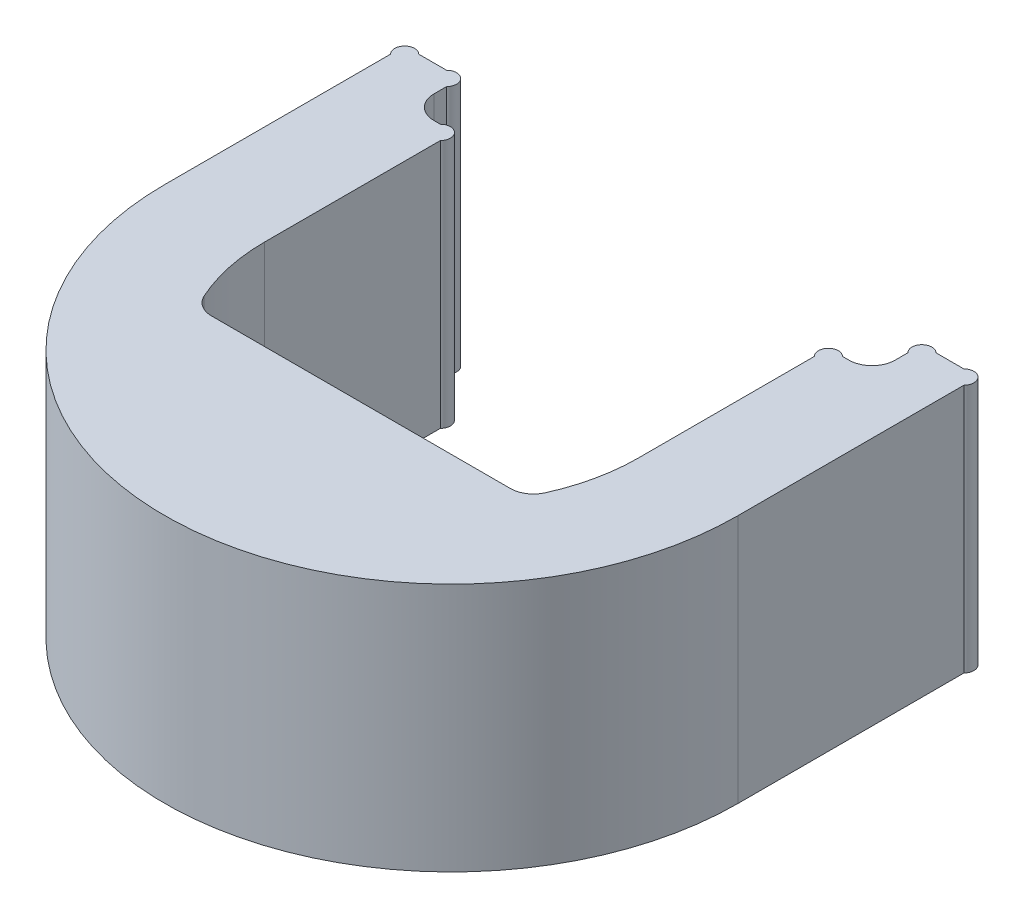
ISO-10303-21;
HEADER;
FILE_DESCRIPTION(('STEP AP214'),'2;1');
FILE_NAME('part.step','',(''),(''),'','','');
FILE_SCHEMA(('AUTOMOTIVE_DESIGN { 1 0 10303 214 1 1 1 1 }'));
ENDSEC;
DATA;
#1=APPLICATION_CONTEXT('core data for automotive mechanical design processes');
#2=APPLICATION_PROTOCOL_DEFINITION('international standard','automotive_design',2000,#1);
#3=PRODUCT_CONTEXT('',#1,'mechanical');
#4=PRODUCT('Part','Part','',(#3));
#5=PRODUCT_RELATED_PRODUCT_CATEGORY('part','',(#4));
#6=PRODUCT_DEFINITION_FORMATION('','',#4);
#7=PRODUCT_DEFINITION_CONTEXT('part definition',#1,'design');
#8=PRODUCT_DEFINITION('design','',#6,#7);
#9=PRODUCT_DEFINITION_SHAPE('','',#8);
#10=(LENGTH_UNIT() NAMED_UNIT(*) SI_UNIT(.MILLI.,.METRE.));
#11=(NAMED_UNIT(*) PLANE_ANGLE_UNIT() SI_UNIT($,.RADIAN.));
#12=(NAMED_UNIT(*) SI_UNIT($,.STERADIAN.) SOLID_ANGLE_UNIT());
#13=UNCERTAINTY_MEASURE_WITH_UNIT(LENGTH_MEASURE(1.E-05),#10,'distance_accuracy_value','');
#14=(GEOMETRIC_REPRESENTATION_CONTEXT(3) GLOBAL_UNCERTAINTY_ASSIGNED_CONTEXT((#13)) GLOBAL_UNIT_ASSIGNED_CONTEXT((#10,
#11,#12)) REPRESENTATION_CONTEXT('',''));
#15=CARTESIAN_POINT('',(0.,0.,0.));
#16=DIRECTION('',(0.,0.,1.));
#17=DIRECTION('',(1.,0.,0.));
#18=AXIS2_PLACEMENT_3D('',#15,#16,#17);
#19=CARTESIAN_POINT('',(-23.9802001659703,40.,40.8));
#20=DIRECTION('',(0.,-1.,0.));
#21=DIRECTION('',(0.,0.,-1.));
#22=AXIS2_PLACEMENT_3D('',#19,#20,#21);
#23=CYLINDRICAL_SURFACE('',#22,3.7);
#24=CARTESIAN_POINT('',(-23.9802001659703,0.,40.8));
#25=DIRECTION('',(0.,-1.,0.));
#26=DIRECTION('',(0.,0.,-1.));
#27=AXIS2_PLACEMENT_3D('',#24,#25,#26);
#28=CIRCLE('',#27,3.7);
#29=CARTESIAN_POINT('',(-23.9802001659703,0.,44.5));
#30=VERTEX_POINT('',#29);
#31=CARTESIAN_POINT('',(-27.3538404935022,0.,42.319391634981));
#32=VERTEX_POINT('',#31);
#33=EDGE_CURVE('E225',#30,#32,#28,.T.);
#34=ORIENTED_EDGE('',*,*,#33,.T.);
#35=DIRECTION('',(0.,-1.,0.));
#36=VECTOR('',#35,1.);
#37=CARTESIAN_POINT('',(-27.3538404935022,40.,42.319391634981));
#38=LINE('',#37,#36);
#39=CARTESIAN_POINT('',(-27.3538404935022,40.,42.319391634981));
#40=VERTEX_POINT('',#39);
#41=EDGE_CURVE('E11',#40,#32,#38,.T.);
#42=ORIENTED_EDGE('',*,*,#41,.F.);
#43=CARTESIAN_POINT('',(-23.9802001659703,40.,40.8));
#44=DIRECTION('',(0.,-1.,0.));
#45=DIRECTION('',(0.,0.,-1.));
#46=AXIS2_PLACEMENT_3D('',#43,#44,#45);
#47=CIRCLE('',#46,3.7);
#48=CARTESIAN_POINT('',(-23.9802001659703,40.,44.5));
#49=VERTEX_POINT('',#48);
#50=EDGE_CURVE('E271',#49,#40,#47,.T.);
#51=ORIENTED_EDGE('',*,*,#50,.F.);
#52=DIRECTION('',(0.,-1.,0.));
#53=VECTOR('',#52,1.);
#54=CARTESIAN_POINT('',(-23.9802001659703,40.,44.5));
#55=LINE('',#54,#53);
#56=EDGE_CURVE('E221',#49,#30,#55,.T.);
#57=ORIENTED_EDGE('',*,*,#56,.T.);
#58=EDGE_LOOP('',(#34,#42,#51,#57));
#59=FACE_BOUND('',#58,.T.);
#60=ADVANCED_FACE('F33',(#59),#23,.F.);
#61=CARTESIAN_POINT('',(0.,40.,30.));
#62=DIRECTION('',(0.,-1.,0.));
#63=DIRECTION('',(0.,0.,-1.));
#64=AXIS2_PLACEMENT_3D('',#61,#62,#63);
#65=CYLINDRICAL_SURFACE('',#64,30.);
#66=CARTESIAN_POINT('',(0.,0.,30.));
#67=DIRECTION('',(0.,-1.,0.));
#68=DIRECTION('',(0.,0.,1.));
#69=AXIS2_PLACEMENT_3D('',#66,#67,#68);
#70=CIRCLE('',#69,30.);
#71=CARTESIAN_POINT('',(-30.,0.,30.));
#72=VERTEX_POINT('',#71);
#73=EDGE_CURVE('E228',#32,#72,#70,.T.);
#74=ORIENTED_EDGE('',*,*,#73,.T.);
#75=DIRECTION('',(0.,-1.,0.));
#76=VECTOR('',#75,1.);
#77=CARTESIAN_POINT('',(-30.,40.,30.));
#78=LINE('',#77,#76);
#79=CARTESIAN_POINT('',(-30.,40.,30.));
#80=VERTEX_POINT('',#79);
#81=EDGE_CURVE('E41',#80,#72,#78,.T.);
#82=ORIENTED_EDGE('',*,*,#81,.F.);
#83=CARTESIAN_POINT('',(0.,40.,30.));
#84=DIRECTION('',(0.,-1.,0.));
#85=DIRECTION('',(0.,0.,1.));
#86=AXIS2_PLACEMENT_3D('',#83,#84,#85);
#87=CIRCLE('',#86,30.);
#88=EDGE_CURVE('E140',#40,#80,#87,.T.);
#89=ORIENTED_EDGE('',*,*,#88,.F.);
#90=ORIENTED_EDGE('',*,*,#41,.T.);
#91=EDGE_LOOP('',(#74,#82,#89,#90));
#92=FACE_BOUND('',#91,.T.);
#93=ADVANCED_FACE('F409',(#92),#65,.F.);
#94=CARTESIAN_POINT('',(-30.,40.,30.));
#95=DIRECTION('',(-1.,0.,0.));
#96=DIRECTION('',(0.,0.,1.));
#97=AXIS2_PLACEMENT_3D('',#94,#95,#96);
#98=PLANE('',#97);
#99=DIRECTION('',(0.,0.,-1.));
#100=VECTOR('',#99,1.);
#101=CARTESIAN_POINT('',(-30.,0.,30.));
#102=LINE('',#101,#100);
#103=CARTESIAN_POINT('',(-30.,0.,1.76274169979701));
#104=VERTEX_POINT('',#103);
#105=EDGE_CURVE('E230',#72,#104,#102,.T.);
#106=ORIENTED_EDGE('',*,*,#105,.T.);
#107=DIRECTION('',(0.,-1.,0.));
#108=VECTOR('',#107,1.);
#109=CARTESIAN_POINT('',(-30.,40.,1.76274169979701));
#110=LINE('',#109,#108);
#111=CARTESIAN_POINT('',(-30.,40.,1.76274169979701));
#112=VERTEX_POINT('',#111);
#113=EDGE_CURVE('E326',#112,#104,#110,.T.);
#114=ORIENTED_EDGE('',*,*,#113,.F.);
#115=DIRECTION('',(0.,0.,-1.));
#116=VECTOR('',#115,1.);
#117=CARTESIAN_POINT('',(-30.,40.,30.));
#118=LINE('',#117,#116);
#119=EDGE_CURVE('E334',#80,#112,#118,.T.);
#120=ORIENTED_EDGE('',*,*,#119,.F.);
#121=ORIENTED_EDGE('',*,*,#81,.T.);
#122=EDGE_LOOP('',(#106,#114,#120,#121));
#123=FACE_BOUND('',#122,.T.);
#124=ADVANCED_FACE('F332',(#123),#98,.F.);
#125=CARTESIAN_POINT('',(-31.1313708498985,40.,0.631370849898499));
#126=DIRECTION('',(0.,-1.,0.));
#127=DIRECTION('',(0.,0.,-1.));
#128=AXIS2_PLACEMENT_3D('',#125,#126,#127);
#129=CYLINDRICAL_SURFACE('',#128,1.60000000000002);
#130=CARTESIAN_POINT('',(-31.1313708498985,0.,0.631370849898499));
#131=DIRECTION('',(0.,1.,0.));
#132=DIRECTION('',(0.,0.,-1.));
#133=AXIS2_PLACEMENT_3D('',#130,#131,#132);
#134=CIRCLE('',#133,1.60000000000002);
#135=CARTESIAN_POINT('',(-32.262741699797,0.,-0.49999999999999));
#136=VERTEX_POINT('',#135);
#137=EDGE_CURVE('E232',#104,#136,#134,.T.);
#138=ORIENTED_EDGE('',*,*,#137,.T.);
#139=DIRECTION('',(0.,-1.,0.));
#140=VECTOR('',#139,1.);
#141=CARTESIAN_POINT('',(-32.262741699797,40.,-0.49999999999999));
#142=LINE('',#141,#140);
#143=CARTESIAN_POINT('',(-32.262741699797,40.,-0.49999999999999));
#144=VERTEX_POINT('',#143);
#145=EDGE_CURVE('E323',#144,#136,#142,.T.);
#146=ORIENTED_EDGE('',*,*,#145,.F.);
#147=CARTESIAN_POINT('',(-31.1313708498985,40.,0.631370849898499));
#148=DIRECTION('',(0.,1.,0.));
#149=DIRECTION('',(0.,0.,-1.));
#150=AXIS2_PLACEMENT_3D('',#147,#148,#149);
#151=CIRCLE('',#150,1.60000000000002);
#152=EDGE_CURVE('E352',#112,#144,#151,.T.);
#153=ORIENTED_EDGE('',*,*,#152,.F.);
#154=ORIENTED_EDGE('',*,*,#113,.T.);
#155=EDGE_LOOP('',(#138,#146,#153,#154));
#156=FACE_BOUND('',#155,.T.);
#157=ADVANCED_FACE('F343',(#156),#129,.T.);
#158=CARTESIAN_POINT('',(-32.262741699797,40.,-0.49999999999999));
#159=DIRECTION('',(0.,0.,1.));
#160=DIRECTION('',(1.,0.,0.));
#161=AXIS2_PLACEMENT_3D('',#158,#159,#160);
#162=PLANE('',#161);
#163=DIRECTION('',(-1.,0.,0.));
#164=VECTOR('',#163,1.);
#165=CARTESIAN_POINT('',(-32.262741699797,0.,-0.49999999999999));
#166=LINE('',#165,#164);
#167=CARTESIAN_POINT('',(-33.3,0.,-0.499999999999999));
#168=VERTEX_POINT('',#167);
#169=EDGE_CURVE('E234',#136,#168,#166,.T.);
#170=ORIENTED_EDGE('',*,*,#169,.T.);
#171=DIRECTION('',(0.,-1.,0.));
#172=VECTOR('',#171,1.);
#173=CARTESIAN_POINT('',(-33.3,40.,-0.499999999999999));
#174=LINE('',#173,#172);
#175=CARTESIAN_POINT('',(-33.3,40.,-0.499999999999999));
#176=VERTEX_POINT('',#175);
#177=EDGE_CURVE('E320',#176,#168,#174,.T.);
#178=ORIENTED_EDGE('',*,*,#177,.F.);
#179=DIRECTION('',(-1.,0.,0.));
#180=VECTOR('',#179,1.);
#181=CARTESIAN_POINT('',(-32.262741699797,40.,-0.49999999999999));
#182=LINE('',#181,#180);
#183=EDGE_CURVE('E349',#144,#176,#182,.T.);
#184=ORIENTED_EDGE('',*,*,#183,.F.);
#185=ORIENTED_EDGE('',*,*,#145,.T.);
#186=EDGE_LOOP('',(#170,#178,#184,#185));
#187=FACE_BOUND('',#186,.T.);
#188=ADVANCED_FACE('F347',(#187),#162,.F.);
#189=CARTESIAN_POINT('',(-33.3,40.,-4.2));
#190=DIRECTION('',(0.,-1.,0.));
#191=DIRECTION('',(0.,0.,-1.));
#192=AXIS2_PLACEMENT_3D('',#189,#190,#191);
#193=CYLINDRICAL_SURFACE('',#192,3.7);
#194=CARTESIAN_POINT('',(-33.3,0.,-4.2));
#195=DIRECTION('',(0.,-1.,0.));
#196=DIRECTION('',(0.,0.,1.));
#197=AXIS2_PLACEMENT_3D('',#194,#195,#196);
#198=CIRCLE('',#197,3.7);
#199=CARTESIAN_POINT('',(-37.,0.,-4.20000000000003));
#200=VERTEX_POINT('',#199);
#201=EDGE_CURVE('E236',#168,#200,#198,.T.);
#202=ORIENTED_EDGE('',*,*,#201,.T.);
#203=DIRECTION('',(0.,-1.,0.));
#204=VECTOR('',#203,1.);
#205=CARTESIAN_POINT('',(-37.,40.,-4.20000000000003));
#206=LINE('',#205,#204);
#207=CARTESIAN_POINT('',(-37.,40.,-4.20000000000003));
#208=VERTEX_POINT('',#207);
#209=EDGE_CURVE('E317',#208,#200,#206,.T.);
#210=ORIENTED_EDGE('',*,*,#209,.F.);
#211=CARTESIAN_POINT('',(-33.3,40.,-4.2));
#212=DIRECTION('',(0.,-1.,0.));
#213=DIRECTION('',(0.,0.,1.));
#214=AXIS2_PLACEMENT_3D('',#211,#212,#213);
#215=CIRCLE('',#214,3.7);
#216=EDGE_CURVE('E351',#176,#208,#215,.T.);
#217=ORIENTED_EDGE('',*,*,#216,.F.);
#218=ORIENTED_EDGE('',*,*,#177,.T.);
#219=EDGE_LOOP('',(#202,#210,#217,#218));
#220=FACE_BOUND('',#219,.T.);
#221=ADVANCED_FACE('F422',(#220),#193,.F.);
#222=CARTESIAN_POINT('',(-37.,40.,-4.20000000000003));
#223=DIRECTION('',(-1.,0.,0.));
#224=DIRECTION('',(0.,0.,1.));
#225=AXIS2_PLACEMENT_3D('',#222,#223,#224);
#226=PLANE('',#225);
#227=DIRECTION('',(0.,0.,-1.));
#228=VECTOR('',#227,1.);
#229=CARTESIAN_POINT('',(-37.,0.,-4.20000000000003));
#230=LINE('',#229,#228);
#231=CARTESIAN_POINT('',(-37.,0.,-6.23725830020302));
#232=VERTEX_POINT('',#231);
#233=EDGE_CURVE('E238',#200,#232,#230,.T.);
#234=ORIENTED_EDGE('',*,*,#233,.T.);
#235=DIRECTION('',(0.,-1.,0.));
#236=VECTOR('',#235,1.);
#237=CARTESIAN_POINT('',(-37.,40.,-6.23725830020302));
#238=LINE('',#237,#236);
#239=CARTESIAN_POINT('',(-37.,40.,-6.23725830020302));
#240=VERTEX_POINT('',#239);
#241=EDGE_CURVE('E314',#240,#232,#238,.T.);
#242=ORIENTED_EDGE('',*,*,#241,.F.);
#243=DIRECTION('',(0.,0.,-1.));
#244=VECTOR('',#243,1.);
#245=CARTESIAN_POINT('',(-37.,40.,-4.20000000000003));
#246=LINE('',#245,#244);
#247=EDGE_CURVE('E354',#208,#240,#246,.T.);
#248=ORIENTED_EDGE('',*,*,#247,.F.);
#249=ORIENTED_EDGE('',*,*,#209,.T.);
#250=EDGE_LOOP('',(#234,#242,#248,#249));
#251=FACE_BOUND('',#250,.T.);
#252=ADVANCED_FACE('F425',(#251),#226,.F.);
#253=CARTESIAN_POINT('',(-38.1313708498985,40.,-7.3686291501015));
#254=DIRECTION('',(0.,-1.,0.));
#255=DIRECTION('',(0.,0.,-1.));
#256=AXIS2_PLACEMENT_3D('',#253,#254,#255);
#257=CYLINDRICAL_SURFACE('',#256,1.6);
#258=CARTESIAN_POINT('',(-38.1313708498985,0.,-7.3686291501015));
#259=DIRECTION('',(0.,1.,0.));
#260=DIRECTION('',(0.,0.,-1.));
#261=AXIS2_PLACEMENT_3D('',#258,#259,#260);
#262=CIRCLE('',#261,1.6);
#263=CARTESIAN_POINT('',(-39.2627416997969,0.,-8.5));
#264=VERTEX_POINT('',#263);
#265=EDGE_CURVE('E240',#232,#264,#262,.T.);
#266=ORIENTED_EDGE('',*,*,#265,.T.);
#267=DIRECTION('',(0.,-1.,0.));
#268=VECTOR('',#267,1.);
#269=CARTESIAN_POINT('',(-39.2627416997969,40.,-8.5));
#270=LINE('',#269,#268);
#271=CARTESIAN_POINT('',(-39.2627416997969,40.,-8.5));
#272=VERTEX_POINT('',#271);
#273=EDGE_CURVE('E311',#272,#264,#270,.T.);
#274=ORIENTED_EDGE('',*,*,#273,.F.);
#275=CARTESIAN_POINT('',(-38.1313708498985,40.,-7.3686291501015));
#276=DIRECTION('',(0.,1.,0.));
#277=DIRECTION('',(0.,0.,-1.));
#278=AXIS2_PLACEMENT_3D('',#275,#276,#277);
#279=CIRCLE('',#278,1.6);
#280=EDGE_CURVE('E360',#240,#272,#279,.T.);
#281=ORIENTED_EDGE('',*,*,#280,.F.);
#282=ORIENTED_EDGE('',*,*,#241,.T.);
#283=EDGE_LOOP('',(#266,#274,#281,#282));
#284=FACE_BOUND('',#283,.T.);
#285=ADVANCED_FACE('F429',(#284),#257,.T.);
#286=CARTESIAN_POINT('',(-39.2627416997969,40.,-8.5));
#287=DIRECTION('',(0.,0.,1.));
#288=DIRECTION('',(1.,0.,0.));
#289=AXIS2_PLACEMENT_3D('',#286,#287,#288);
#290=PLANE('',#289);
#291=DIRECTION('',(-1.,0.,0.));
#292=VECTOR('',#291,1.);
#293=CARTESIAN_POINT('',(-39.2627416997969,0.,-8.5));
#294=LINE('',#293,#292);
#295=CARTESIAN_POINT('',(-43.737258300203,0.,-8.5));
#296=VERTEX_POINT('',#295);
#297=EDGE_CURVE('E242',#264,#296,#294,.T.);
#298=ORIENTED_EDGE('',*,*,#297,.T.);
#299=DIRECTION('',(0.,-1.,0.));
#300=VECTOR('',#299,1.);
#301=CARTESIAN_POINT('',(-43.737258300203,40.,-8.5));
#302=LINE('',#301,#300);
#303=CARTESIAN_POINT('',(-43.737258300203,40.,-8.5));
#304=VERTEX_POINT('',#303);
#305=EDGE_CURVE('E308',#304,#296,#302,.T.);
#306=ORIENTED_EDGE('',*,*,#305,.F.);
#307=DIRECTION('',(-1.,0.,0.));
#308=VECTOR('',#307,1.);
#309=CARTESIAN_POINT('',(-39.2627416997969,40.,-8.5));
#310=LINE('',#309,#308);
#311=EDGE_CURVE('E362',#272,#304,#310,.T.);
#312=ORIENTED_EDGE('',*,*,#311,.F.);
#313=ORIENTED_EDGE('',*,*,#273,.T.);
#314=EDGE_LOOP('',(#298,#306,#312,#313));
#315=FACE_BOUND('',#314,.T.);
#316=ADVANCED_FACE('F433',(#315),#290,.F.);
#317=CARTESIAN_POINT('',(-44.8686291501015,40.,-7.36862915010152));
#318=DIRECTION('',(0.,-1.,0.));
#319=DIRECTION('',(0.,0.,-1.));
#320=AXIS2_PLACEMENT_3D('',#317,#318,#319);
#321=CYLINDRICAL_SURFACE('',#320,1.6);
#322=CARTESIAN_POINT('',(-44.8686291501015,0.,-7.36862915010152));
#323=DIRECTION('',(0.,1.,0.));
#324=DIRECTION('',(0.,0.,-1.));
#325=AXIS2_PLACEMENT_3D('',#322,#323,#324);
#326=CIRCLE('',#325,1.6);
#327=CARTESIAN_POINT('',(-46.,0.,-6.23725830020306));
#328=VERTEX_POINT('',#327);
#329=EDGE_CURVE('E244',#296,#328,#326,.T.);
#330=ORIENTED_EDGE('',*,*,#329,.T.);
#331=DIRECTION('',(0.,-1.,0.));
#332=VECTOR('',#331,1.);
#333=CARTESIAN_POINT('',(-46.,40.,-6.23725830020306));
#334=LINE('',#333,#332);
#335=CARTESIAN_POINT('',(-46.,40.,-6.23725830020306));
#336=VERTEX_POINT('',#335);
#337=EDGE_CURVE('E305',#336,#328,#334,.T.);
#338=ORIENTED_EDGE('',*,*,#337,.F.);
#339=CARTESIAN_POINT('',(-44.8686291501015,40.,-7.36862915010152));
#340=DIRECTION('',(0.,1.,0.));
#341=DIRECTION('',(0.,0.,-1.));
#342=AXIS2_PLACEMENT_3D('',#339,#340,#341);
#343=CIRCLE('',#342,1.6);
#344=EDGE_CURVE('E364',#304,#336,#343,.T.);
#345=ORIENTED_EDGE('',*,*,#344,.F.);
#346=ORIENTED_EDGE('',*,*,#305,.T.);
#347=EDGE_LOOP('',(#330,#338,#345,#346));
#348=FACE_BOUND('',#347,.T.);
#349=ADVANCED_FACE('F437',(#348),#321,.T.);
#350=CARTESIAN_POINT('',(-46.,40.,-6.23725830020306));
#351=DIRECTION('',(1.,0.,0.));
#352=DIRECTION('',(0.,0.,-1.));
#353=AXIS2_PLACEMENT_3D('',#350,#351,#352);
#354=PLANE('',#353);
#355=DIRECTION('',(0.,0.,1.));
#356=VECTOR('',#355,1.);
#357=CARTESIAN_POINT('',(-46.,0.,-6.23725830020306));
#358=LINE('',#357,#356);
#359=CARTESIAN_POINT('',(-46.,0.,30.));
#360=VERTEX_POINT('',#359);
#361=EDGE_CURVE('E246',#328,#360,#358,.T.);
#362=ORIENTED_EDGE('',*,*,#361,.T.);
#363=DIRECTION('',(0.,-1.,0.));
#364=VECTOR('',#363,1.);
#365=CARTESIAN_POINT('',(-46.,40.,30.));
#366=LINE('',#365,#364);
#367=CARTESIAN_POINT('',(-46.,40.,30.));
#368=VERTEX_POINT('',#367);
#369=EDGE_CURVE('E302',#368,#360,#366,.T.);
#370=ORIENTED_EDGE('',*,*,#369,.F.);
#371=DIRECTION('',(0.,0.,1.));
#372=VECTOR('',#371,1.);
#373=CARTESIAN_POINT('',(-46.,40.,-6.23725830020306));
#374=LINE('',#373,#372);
#375=EDGE_CURVE('E366',#336,#368,#374,.T.);
#376=ORIENTED_EDGE('',*,*,#375,.F.);
#377=ORIENTED_EDGE('',*,*,#337,.T.);
#378=EDGE_LOOP('',(#362,#370,#376,#377));
#379=FACE_BOUND('',#378,.T.);
#380=ADVANCED_FACE('F441',(#379),#354,.F.);
#381=CARTESIAN_POINT('',(0.,40.,30.));
#382=DIRECTION('',(0.,-1.,0.));
#383=DIRECTION('',(0.,0.,-1.));
#384=AXIS2_PLACEMENT_3D('',#381,#382,#383);
#385=CYLINDRICAL_SURFACE('',#384,46.);
#386=CARTESIAN_POINT('',(0.,0.,30.));
#387=DIRECTION('',(0.,1.,0.));
#388=DIRECTION('',(0.,0.,1.));
#389=AXIS2_PLACEMENT_3D('',#386,#387,#388);
#390=CIRCLE('',#389,46.);
#391=CARTESIAN_POINT('',(46.,0.,30.));
#392=VERTEX_POINT('',#391);
#393=EDGE_CURVE('E248',#360,#392,#390,.T.);
#394=ORIENTED_EDGE('',*,*,#393,.T.);
#395=DIRECTION('',(0.,-1.,0.));
#396=VECTOR('',#395,1.);
#397=CARTESIAN_POINT('',(46.,40.,30.));
#398=LINE('',#397,#396);
#399=CARTESIAN_POINT('',(46.,40.,30.));
#400=VERTEX_POINT('',#399);
#401=EDGE_CURVE('E299',#400,#392,#398,.T.);
#402=ORIENTED_EDGE('',*,*,#401,.F.);
#403=CARTESIAN_POINT('',(0.,40.,30.));
#404=DIRECTION('',(0.,1.,0.));
#405=DIRECTION('',(0.,0.,1.));
#406=AXIS2_PLACEMENT_3D('',#403,#404,#405);
#407=CIRCLE('',#406,46.);
#408=EDGE_CURVE('E368',#368,#400,#407,.T.);
#409=ORIENTED_EDGE('',*,*,#408,.F.);
#410=ORIENTED_EDGE('',*,*,#369,.T.);
#411=EDGE_LOOP('',(#394,#402,#409,#410));
#412=FACE_BOUND('',#411,.T.);
#413=ADVANCED_FACE('F445',(#412),#385,.T.);
#414=CARTESIAN_POINT('',(46.,40.,-6.23725830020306));
#415=DIRECTION('',(-1.,0.,0.));
#416=DIRECTION('',(0.,0.,1.));
#417=AXIS2_PLACEMENT_3D('',#414,#415,#416);
#418=PLANE('',#417);
#419=DIRECTION('',(0.,0.,-1.));
#420=VECTOR('',#419,1.);
#421=CARTESIAN_POINT('',(46.,0.,-6.23725830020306));
#422=LINE('',#421,#420);
#423=CARTESIAN_POINT('',(46.,0.,-6.23725830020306));
#424=VERTEX_POINT('',#423);
#425=EDGE_CURVE('E250',#392,#424,#422,.T.);
#426=ORIENTED_EDGE('',*,*,#425,.T.);
#427=DIRECTION('',(0.,-1.,0.));
#428=VECTOR('',#427,1.);
#429=CARTESIAN_POINT('',(46.,40.,-6.23725830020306));
#430=LINE('',#429,#428);
#431=CARTESIAN_POINT('',(46.,40.,-6.23725830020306));
#432=VERTEX_POINT('',#431);
#433=EDGE_CURVE('E296',#432,#424,#430,.T.);
#434=ORIENTED_EDGE('',*,*,#433,.F.);
#435=DIRECTION('',(0.,0.,-1.));
#436=VECTOR('',#435,1.);
#437=CARTESIAN_POINT('',(46.,40.,-6.23725830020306));
#438=LINE('',#437,#436);
#439=EDGE_CURVE('E370',#400,#432,#438,.T.);
#440=ORIENTED_EDGE('',*,*,#439,.F.);
#441=ORIENTED_EDGE('',*,*,#401,.T.);
#442=EDGE_LOOP('',(#426,#434,#440,#441));
#443=FACE_BOUND('',#442,.T.);
#444=ADVANCED_FACE('F449',(#443),#418,.F.);
#445=CARTESIAN_POINT('',(44.8686291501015,40.,-7.36862915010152));
#446=DIRECTION('',(0.,-1.,0.));
#447=DIRECTION('',(0.,0.,-1.));
#448=AXIS2_PLACEMENT_3D('',#445,#446,#447);
#449=CYLINDRICAL_SURFACE('',#448,1.6);
#450=CARTESIAN_POINT('',(44.8686291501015,0.,-7.36862915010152));
#451=DIRECTION('',(0.,1.,0.));
#452=DIRECTION('',(0.,0.,1.));
#453=AXIS2_PLACEMENT_3D('',#450,#451,#452);
#454=CIRCLE('',#453,1.6);
#455=CARTESIAN_POINT('',(43.737258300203,0.,-8.5));
#456=VERTEX_POINT('',#455);
#457=EDGE_CURVE('E252',#424,#456,#454,.T.);
#458=ORIENTED_EDGE('',*,*,#457,.T.);
#459=DIRECTION('',(0.,-1.,0.));
#460=VECTOR('',#459,1.);
#461=CARTESIAN_POINT('',(43.737258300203,40.,-8.5));
#462=LINE('',#461,#460);
#463=CARTESIAN_POINT('',(43.737258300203,40.,-8.5));
#464=VERTEX_POINT('',#463);
#465=EDGE_CURVE('E293',#464,#456,#462,.T.);
#466=ORIENTED_EDGE('',*,*,#465,.F.);
#467=CARTESIAN_POINT('',(44.8686291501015,40.,-7.36862915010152));
#468=DIRECTION('',(0.,1.,0.));
#469=DIRECTION('',(0.,0.,1.));
#470=AXIS2_PLACEMENT_3D('',#467,#468,#469);
#471=CIRCLE('',#470,1.6);
#472=EDGE_CURVE('E372',#432,#464,#471,.T.);
#473=ORIENTED_EDGE('',*,*,#472,.F.);
#474=ORIENTED_EDGE('',*,*,#433,.T.);
#475=EDGE_LOOP('',(#458,#466,#473,#474));
#476=FACE_BOUND('',#475,.T.);
#477=ADVANCED_FACE('F453',(#476),#449,.T.);
#478=CARTESIAN_POINT('',(39.2627416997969,40.,-8.5));
#479=DIRECTION('',(0.,0.,1.));
#480=DIRECTION('',(1.,0.,0.));
#481=AXIS2_PLACEMENT_3D('',#478,#479,#480);
#482=PLANE('',#481);
#483=DIRECTION('',(-1.,0.,0.));
#484=VECTOR('',#483,1.);
#485=CARTESIAN_POINT('',(39.2627416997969,0.,-8.5));
#486=LINE('',#485,#484);
#487=CARTESIAN_POINT('',(39.2627416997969,0.,-8.5));
#488=VERTEX_POINT('',#487);
#489=EDGE_CURVE('E254',#456,#488,#486,.T.);
#490=ORIENTED_EDGE('',*,*,#489,.T.);
#491=DIRECTION('',(0.,-1.,0.));
#492=VECTOR('',#491,1.);
#493=CARTESIAN_POINT('',(39.2627416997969,40.,-8.5));
#494=LINE('',#493,#492);
#495=CARTESIAN_POINT('',(39.2627416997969,40.,-8.5));
#496=VERTEX_POINT('',#495);
#497=EDGE_CURVE('E290',#496,#488,#494,.T.);
#498=ORIENTED_EDGE('',*,*,#497,.F.);
#499=DIRECTION('',(-1.,0.,0.));
#500=VECTOR('',#499,1.);
#501=CARTESIAN_POINT('',(39.2627416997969,40.,-8.5));
#502=LINE('',#501,#500);
#503=EDGE_CURVE('E374',#464,#496,#502,.T.);
#504=ORIENTED_EDGE('',*,*,#503,.F.);
#505=ORIENTED_EDGE('',*,*,#465,.T.);
#506=EDGE_LOOP('',(#490,#498,#504,#505));
#507=FACE_BOUND('',#506,.T.);
#508=ADVANCED_FACE('F457',(#507),#482,.F.);
#509=CARTESIAN_POINT('',(38.1313708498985,40.,-7.3686291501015));
#510=DIRECTION('',(0.,-1.,0.));
#511=DIRECTION('',(0.,0.,-1.));
#512=AXIS2_PLACEMENT_3D('',#509,#510,#511);
#513=CYLINDRICAL_SURFACE('',#512,1.6);
#514=CARTESIAN_POINT('',(38.1313708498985,0.,-7.3686291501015));
#515=DIRECTION('',(0.,1.,0.));
#516=DIRECTION('',(0.,0.,1.));
#517=AXIS2_PLACEMENT_3D('',#514,#515,#516);
#518=CIRCLE('',#517,1.6);
#519=CARTESIAN_POINT('',(37.,0.,-6.23725830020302));
#520=VERTEX_POINT('',#519);
#521=EDGE_CURVE('E256',#488,#520,#518,.T.);
#522=ORIENTED_EDGE('',*,*,#521,.T.);
#523=DIRECTION('',(0.,-1.,0.));
#524=VECTOR('',#523,1.);
#525=CARTESIAN_POINT('',(37.,40.,-6.23725830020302));
#526=LINE('',#525,#524);
#527=CARTESIAN_POINT('',(37.,40.,-6.23725830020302));
#528=VERTEX_POINT('',#527);
#529=EDGE_CURVE('E287',#528,#520,#526,.T.);
#530=ORIENTED_EDGE('',*,*,#529,.F.);
#531=CARTESIAN_POINT('',(38.1313708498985,40.,-7.3686291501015));
#532=DIRECTION('',(0.,1.,0.));
#533=DIRECTION('',(0.,0.,1.));
#534=AXIS2_PLACEMENT_3D('',#531,#532,#533);
#535=CIRCLE('',#534,1.6);
#536=EDGE_CURVE('E376',#496,#528,#535,.T.);
#537=ORIENTED_EDGE('',*,*,#536,.F.);
#538=ORIENTED_EDGE('',*,*,#497,.T.);
#539=EDGE_LOOP('',(#522,#530,#537,#538));
#540=FACE_BOUND('',#539,.T.);
#541=ADVANCED_FACE('F461',(#540),#513,.T.);
#542=CARTESIAN_POINT('',(37.,40.,-4.20000000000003));
#543=DIRECTION('',(1.,0.,0.));
#544=DIRECTION('',(0.,0.,-1.));
#545=AXIS2_PLACEMENT_3D('',#542,#543,#544);
#546=PLANE('',#545);
#547=DIRECTION('',(0.,0.,1.));
#548=VECTOR('',#547,1.);
#549=CARTESIAN_POINT('',(37.,0.,-4.20000000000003));
#550=LINE('',#549,#548);
#551=CARTESIAN_POINT('',(37.,0.,-4.20000000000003));
#552=VERTEX_POINT('',#551);
#553=EDGE_CURVE('E258',#520,#552,#550,.T.);
#554=ORIENTED_EDGE('',*,*,#553,.T.);
#555=DIRECTION('',(0.,-1.,0.));
#556=VECTOR('',#555,1.);
#557=CARTESIAN_POINT('',(37.,40.,-4.20000000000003));
#558=LINE('',#557,#556);
#559=CARTESIAN_POINT('',(37.,40.,-4.20000000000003));
#560=VERTEX_POINT('',#559);
#561=EDGE_CURVE('E284',#560,#552,#558,.T.);
#562=ORIENTED_EDGE('',*,*,#561,.F.);
#563=DIRECTION('',(0.,0.,1.));
#564=VECTOR('',#563,1.);
#565=CARTESIAN_POINT('',(37.,40.,-4.20000000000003));
#566=LINE('',#565,#564);
#567=EDGE_CURVE('E378',#528,#560,#566,.T.);
#568=ORIENTED_EDGE('',*,*,#567,.F.);
#569=ORIENTED_EDGE('',*,*,#529,.T.);
#570=EDGE_LOOP('',(#554,#562,#568,#569));
#571=FACE_BOUND('',#570,.T.);
#572=ADVANCED_FACE('F465',(#571),#546,.F.);
#573=CARTESIAN_POINT('',(33.3,40.,-4.2));
#574=DIRECTION('',(0.,-1.,0.));
#575=DIRECTION('',(0.,0.,-1.));
#576=AXIS2_PLACEMENT_3D('',#573,#574,#575);
#577=CYLINDRICAL_SURFACE('',#576,3.70000000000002);
#578=CARTESIAN_POINT('',(33.3,0.,-4.2));
#579=DIRECTION('',(0.,-1.,0.));
#580=DIRECTION('',(0.,0.,-1.));
#581=AXIS2_PLACEMENT_3D('',#578,#579,#580);
#582=CIRCLE('',#581,3.70000000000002);
#583=CARTESIAN_POINT('',(33.3,0.,-0.499999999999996));
#584=VERTEX_POINT('',#583);
#585=EDGE_CURVE('E260',#552,#584,#582,.T.);
#586=ORIENTED_EDGE('',*,*,#585,.T.);
#587=DIRECTION('',(0.,-1.,0.));
#588=VECTOR('',#587,1.);
#589=CARTESIAN_POINT('',(33.3,40.,-0.499999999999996));
#590=LINE('',#589,#588);
#591=CARTESIAN_POINT('',(33.3,40.,-0.499999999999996));
#592=VERTEX_POINT('',#591);
#593=EDGE_CURVE('E281',#592,#584,#590,.T.);
#594=ORIENTED_EDGE('',*,*,#593,.F.);
#595=CARTESIAN_POINT('',(33.3,40.,-4.2));
#596=DIRECTION('',(0.,-1.,0.));
#597=DIRECTION('',(0.,0.,-1.));
#598=AXIS2_PLACEMENT_3D('',#595,#596,#597);
#599=CIRCLE('',#598,3.70000000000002);
#600=EDGE_CURVE('E380',#560,#592,#599,.T.);
#601=ORIENTED_EDGE('',*,*,#600,.F.);
#602=ORIENTED_EDGE('',*,*,#561,.T.);
#603=EDGE_LOOP('',(#586,#594,#601,#602));
#604=FACE_BOUND('',#603,.T.);
#605=ADVANCED_FACE('F469',(#604),#577,.F.);
#606=CARTESIAN_POINT('',(32.262741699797,40.,-0.49999999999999));
#607=DIRECTION('',(0.,0.,1.));
#608=DIRECTION('',(1.,0.,0.));
#609=AXIS2_PLACEMENT_3D('',#606,#607,#608);
#610=PLANE('',#609);
#611=DIRECTION('',(-1.,0.,0.));
#612=VECTOR('',#611,1.);
#613=CARTESIAN_POINT('',(32.262741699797,0.,-0.49999999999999));
#614=LINE('',#613,#612);
#615=CARTESIAN_POINT('',(32.262741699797,0.,-0.499999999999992));
#616=VERTEX_POINT('',#615);
#617=EDGE_CURVE('E262',#584,#616,#614,.T.);
#618=ORIENTED_EDGE('',*,*,#617,.T.);
#619=DIRECTION('',(0.,-1.,0.));
#620=VECTOR('',#619,1.);
#621=CARTESIAN_POINT('',(32.262741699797,40.,-0.499999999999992));
#622=LINE('',#621,#620);
#623=CARTESIAN_POINT('',(32.262741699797,40.,-0.499999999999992));
#624=VERTEX_POINT('',#623);
#625=EDGE_CURVE('E278',#624,#616,#622,.T.);
#626=ORIENTED_EDGE('',*,*,#625,.F.);
#627=DIRECTION('',(-1.,0.,0.));
#628=VECTOR('',#627,1.);
#629=CARTESIAN_POINT('',(32.262741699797,40.,-0.49999999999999));
#630=LINE('',#629,#628);
#631=EDGE_CURVE('E382',#592,#624,#630,.T.);
#632=ORIENTED_EDGE('',*,*,#631,.F.);
#633=ORIENTED_EDGE('',*,*,#593,.T.);
#634=EDGE_LOOP('',(#618,#626,#632,#633));
#635=FACE_BOUND('',#634,.T.);
#636=ADVANCED_FACE('F473',(#635),#610,.F.);
#637=CARTESIAN_POINT('',(31.1313708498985,40.,0.631370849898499));
#638=DIRECTION('',(0.,-1.,0.));
#639=DIRECTION('',(0.,0.,-1.));
#640=AXIS2_PLACEMENT_3D('',#637,#638,#639);
#641=CYLINDRICAL_SURFACE('',#640,1.60000000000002);
#642=CARTESIAN_POINT('',(31.1313708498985,0.,0.631370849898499));
#643=DIRECTION('',(0.,1.,0.));
#644=DIRECTION('',(0.,0.,1.));
#645=AXIS2_PLACEMENT_3D('',#642,#643,#644);
#646=CIRCLE('',#645,1.60000000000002);
#647=CARTESIAN_POINT('',(30.,0.,1.76274169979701));
#648=VERTEX_POINT('',#647);
#649=EDGE_CURVE('E264',#616,#648,#646,.T.);
#650=ORIENTED_EDGE('',*,*,#649,.T.);
#651=DIRECTION('',(0.,-1.,0.));
#652=VECTOR('',#651,1.);
#653=CARTESIAN_POINT('',(30.,40.,1.76274169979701));
#654=LINE('',#653,#652);
#655=CARTESIAN_POINT('',(30.,40.,1.76274169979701));
#656=VERTEX_POINT('',#655);
#657=EDGE_CURVE('E275',#656,#648,#654,.T.);
#658=ORIENTED_EDGE('',*,*,#657,.F.);
#659=CARTESIAN_POINT('',(31.1313708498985,40.,0.631370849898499));
#660=DIRECTION('',(0.,1.,0.));
#661=DIRECTION('',(0.,0.,1.));
#662=AXIS2_PLACEMENT_3D('',#659,#660,#661);
#663=CIRCLE('',#662,1.60000000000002);
#664=EDGE_CURVE('E384',#624,#656,#663,.T.);
#665=ORIENTED_EDGE('',*,*,#664,.F.);
#666=ORIENTED_EDGE('',*,*,#625,.T.);
#667=EDGE_LOOP('',(#650,#658,#665,#666));
#668=FACE_BOUND('',#667,.T.);
#669=ADVANCED_FACE('F390',(#668),#641,.T.);
#670=CARTESIAN_POINT('',(30.,40.,30.));
#671=DIRECTION('',(1.,0.,0.));
#672=DIRECTION('',(0.,0.,-1.));
#673=AXIS2_PLACEMENT_3D('',#670,#671,#672);
#674=PLANE('',#673);
#675=DIRECTION('',(0.,0.,1.));
#676=VECTOR('',#675,1.);
#677=CARTESIAN_POINT('',(30.,0.,30.));
#678=LINE('',#677,#676);
#679=CARTESIAN_POINT('',(30.,0.,30.));
#680=VERTEX_POINT('',#679);
#681=EDGE_CURVE('E266',#648,#680,#678,.T.);
#682=ORIENTED_EDGE('',*,*,#681,.T.);
#683=DIRECTION('',(0.,-1.,0.));
#684=VECTOR('',#683,1.);
#685=CARTESIAN_POINT('',(30.,40.,30.));
#686=LINE('',#685,#684);
#687=CARTESIAN_POINT('',(30.,40.,30.));
#688=VERTEX_POINT('',#687);
#689=EDGE_CURVE('E216',#688,#680,#686,.T.);
#690=ORIENTED_EDGE('',*,*,#689,.F.);
#691=DIRECTION('',(0.,0.,1.));
#692=VECTOR('',#691,1.);
#693=CARTESIAN_POINT('',(30.,40.,30.));
#694=LINE('',#693,#692);
#695=EDGE_CURVE('E207',#656,#688,#694,.T.);
#696=ORIENTED_EDGE('',*,*,#695,.F.);
#697=ORIENTED_EDGE('',*,*,#657,.T.);
#698=EDGE_LOOP('',(#682,#690,#696,#697));
#699=FACE_BOUND('',#698,.T.);
#700=ADVANCED_FACE('F394',(#699),#674,.F.);
#701=CARTESIAN_POINT('',(0.,40.,30.));
#702=DIRECTION('',(0.,-1.,0.));
#703=DIRECTION('',(0.,0.,-1.));
#704=AXIS2_PLACEMENT_3D('',#701,#702,#703);
#705=CYLINDRICAL_SURFACE('',#704,30.);
#706=CARTESIAN_POINT('',(0.,0.,30.));
#707=DIRECTION('',(0.,-1.,0.));
#708=DIRECTION('',(0.,0.,1.));
#709=AXIS2_PLACEMENT_3D('',#706,#707,#708);
#710=CIRCLE('',#709,30.);
#711=CARTESIAN_POINT('',(27.3538404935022,0.,42.319391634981));
#712=VERTEX_POINT('',#711);
#713=EDGE_CURVE('E215',#680,#712,#710,.T.);
#714=ORIENTED_EDGE('',*,*,#713,.T.);
#715=DIRECTION('',(0.,-1.,0.));
#716=VECTOR('',#715,1.);
#717=CARTESIAN_POINT('',(27.3538404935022,40.,42.319391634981));
#718=LINE('',#717,#716);
#719=CARTESIAN_POINT('',(27.3538404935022,40.,42.319391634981));
#720=VERTEX_POINT('',#719);
#721=EDGE_CURVE('E212',#720,#712,#718,.T.);
#722=ORIENTED_EDGE('',*,*,#721,.F.);
#723=CARTESIAN_POINT('',(0.,40.,30.));
#724=DIRECTION('',(0.,-1.,0.));
#725=DIRECTION('',(0.,0.,1.));
#726=AXIS2_PLACEMENT_3D('',#723,#724,#725);
#727=CIRCLE('',#726,30.);
#728=EDGE_CURVE('E201',#688,#720,#727,.T.);
#729=ORIENTED_EDGE('',*,*,#728,.F.);
#730=ORIENTED_EDGE('',*,*,#689,.T.);
#731=EDGE_LOOP('',(#714,#722,#729,#730));
#732=FACE_BOUND('',#731,.T.);
#733=ADVANCED_FACE('F213',(#732),#705,.F.);
#734=CARTESIAN_POINT('',(23.9802001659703,40.,40.8));
#735=DIRECTION('',(0.,-1.,0.));
#736=DIRECTION('',(0.,0.,-1.));
#737=AXIS2_PLACEMENT_3D('',#734,#735,#736);
#738=CYLINDRICAL_SURFACE('',#737,3.7);
#739=CARTESIAN_POINT('',(23.9802001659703,0.,40.8));
#740=DIRECTION('',(0.,-1.,0.));
#741=DIRECTION('',(0.,0.,1.));
#742=AXIS2_PLACEMENT_3D('',#739,#740,#741);
#743=CIRCLE('',#742,3.7);
#744=CARTESIAN_POINT('',(23.9802001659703,0.,44.5));
#745=VERTEX_POINT('',#744);
#746=EDGE_CURVE('E126',#712,#745,#743,.T.);
#747=ORIENTED_EDGE('',*,*,#746,.T.);
#748=DIRECTION('',(0.,-1.,0.));
#749=VECTOR('',#748,1.);
#750=CARTESIAN_POINT('',(23.9802001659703,40.,44.5));
#751=LINE('',#750,#749);
#752=CARTESIAN_POINT('',(23.9802001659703,40.,44.5));
#753=VERTEX_POINT('',#752);
#754=EDGE_CURVE('E217',#753,#745,#751,.T.);
#755=ORIENTED_EDGE('',*,*,#754,.F.);
#756=CARTESIAN_POINT('',(23.9802001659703,40.,40.8));
#757=DIRECTION('',(0.,-1.,0.));
#758=DIRECTION('',(0.,0.,1.));
#759=AXIS2_PLACEMENT_3D('',#756,#757,#758);
#760=CIRCLE('',#759,3.7);
#761=EDGE_CURVE('E205',#720,#753,#760,.T.);
#762=ORIENTED_EDGE('',*,*,#761,.F.);
#763=ORIENTED_EDGE('',*,*,#721,.T.);
#764=EDGE_LOOP('',(#747,#755,#762,#763));
#765=FACE_BOUND('',#764,.T.);
#766=ADVANCED_FACE('F219',(#765),#738,.F.);
#767=CARTESIAN_POINT('',(-23.9802001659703,40.,44.5));
#768=DIRECTION('',(0.,0.,1.));
#769=DIRECTION('',(1.,0.,0.));
#770=AXIS2_PLACEMENT_3D('',#767,#768,#769);
#771=PLANE('',#770);
#772=DIRECTION('',(-1.,0.,0.));
#773=VECTOR('',#772,1.);
#774=CARTESIAN_POINT('',(-23.9802001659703,0.,44.5));
#775=LINE('',#774,#773);
#776=EDGE_CURVE('E132',#745,#30,#775,.T.);
#777=ORIENTED_EDGE('',*,*,#776,.T.);
#778=ORIENTED_EDGE('',*,*,#56,.F.);
#779=DIRECTION('',(-1.,0.,0.));
#780=VECTOR('',#779,1.);
#781=CARTESIAN_POINT('',(-23.9802001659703,40.,44.5));
#782=LINE('',#781,#780);
#783=EDGE_CURVE('E49',#753,#49,#782,.T.);
#784=ORIENTED_EDGE('',*,*,#783,.F.);
#785=ORIENTED_EDGE('',*,*,#754,.T.);
#786=EDGE_LOOP('',(#777,#778,#784,#785));
#787=FACE_BOUND('',#786,.T.);
#788=ADVANCED_FACE('F398',(#787),#771,.F.);
#789=CARTESIAN_POINT('',(-23.9802001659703,40.,40.8));
#790=DIRECTION('',(0.,-1.,0.));
#791=DIRECTION('',(0.,0.,-1.));
#792=AXIS2_PLACEMENT_3D('',#789,#790,#791);
#793=PLANE('',#792);
#794=ORIENTED_EDGE('',*,*,#50,.T.);
#795=ORIENTED_EDGE('',*,*,#88,.T.);
#796=ORIENTED_EDGE('',*,*,#119,.T.);
#797=ORIENTED_EDGE('',*,*,#152,.T.);
#798=ORIENTED_EDGE('',*,*,#183,.T.);
#799=ORIENTED_EDGE('',*,*,#216,.T.);
#800=ORIENTED_EDGE('',*,*,#247,.T.);
#801=ORIENTED_EDGE('',*,*,#280,.T.);
#802=ORIENTED_EDGE('',*,*,#311,.T.);
#803=ORIENTED_EDGE('',*,*,#344,.T.);
#804=ORIENTED_EDGE('',*,*,#375,.T.);
#805=ORIENTED_EDGE('',*,*,#408,.T.);
#806=ORIENTED_EDGE('',*,*,#439,.T.);
#807=ORIENTED_EDGE('',*,*,#472,.T.);
#808=ORIENTED_EDGE('',*,*,#503,.T.);
#809=ORIENTED_EDGE('',*,*,#536,.T.);
#810=ORIENTED_EDGE('',*,*,#567,.T.);
#811=ORIENTED_EDGE('',*,*,#600,.T.);
#812=ORIENTED_EDGE('',*,*,#631,.T.);
#813=ORIENTED_EDGE('',*,*,#664,.T.);
#814=ORIENTED_EDGE('',*,*,#695,.T.);
#815=ORIENTED_EDGE('',*,*,#728,.T.);
#816=ORIENTED_EDGE('',*,*,#761,.T.);
#817=ORIENTED_EDGE('',*,*,#783,.T.);
#818=EDGE_LOOP('',(#794,#795,#796,#797,#798,#799,#800,#801,#802,#803,#804,#805,#806,#807,#808,
#809,#810,#811,#812,#813,#814,#815,#816,#817));
#819=FACE_BOUND('',#818,.T.);
#820=ADVANCED_FACE('F203',(#819),#793,.F.);
#821=CARTESIAN_POINT('',(-23.9802001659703,0.,40.8));
#822=DIRECTION('',(0.,-1.,0.));
#823=DIRECTION('',(0.,0.,-1.));
#824=AXIS2_PLACEMENT_3D('',#821,#822,#823);
#825=PLANE('',#824);
#826=ORIENTED_EDGE('',*,*,#33,.F.);
#827=ORIENTED_EDGE('',*,*,#776,.F.);
#828=ORIENTED_EDGE('',*,*,#746,.F.);
#829=ORIENTED_EDGE('',*,*,#713,.F.);
#830=ORIENTED_EDGE('',*,*,#681,.F.);
#831=ORIENTED_EDGE('',*,*,#649,.F.);
#832=ORIENTED_EDGE('',*,*,#617,.F.);
#833=ORIENTED_EDGE('',*,*,#585,.F.);
#834=ORIENTED_EDGE('',*,*,#553,.F.);
#835=ORIENTED_EDGE('',*,*,#521,.F.);
#836=ORIENTED_EDGE('',*,*,#489,.F.);
#837=ORIENTED_EDGE('',*,*,#457,.F.);
#838=ORIENTED_EDGE('',*,*,#425,.F.);
#839=ORIENTED_EDGE('',*,*,#393,.F.);
#840=ORIENTED_EDGE('',*,*,#361,.F.);
#841=ORIENTED_EDGE('',*,*,#329,.F.);
#842=ORIENTED_EDGE('',*,*,#297,.F.);
#843=ORIENTED_EDGE('',*,*,#265,.F.);
#844=ORIENTED_EDGE('',*,*,#233,.F.);
#845=ORIENTED_EDGE('',*,*,#201,.F.);
#846=ORIENTED_EDGE('',*,*,#169,.F.);
#847=ORIENTED_EDGE('',*,*,#137,.F.);
#848=ORIENTED_EDGE('',*,*,#105,.F.);
#849=ORIENTED_EDGE('',*,*,#73,.F.);
#850=EDGE_LOOP('',(#826,#827,#828,#829,#830,#831,#832,#833,#834,#835,#836,#837,#838,#839,#840,
#841,#842,#843,#844,#845,#846,#847,#848,#849));
#851=FACE_BOUND('',#850,.T.);
#852=ADVANCED_FACE('F338',(#851),#825,.T.);
#853=CLOSED_SHELL('',(#60,#93,#124,#157,#188,#221,#252,#285,#316,#349,#380,#413,#444,#477,#508,
#541,#572,#605,#636,#669,#700,#733,#766,#788,#820,#852));
#854=MANIFOLD_SOLID_BREP('B2',#853);
#855=ADVANCED_BREP_SHAPE_REPRESENTATION('',(#18,#854),#14);
#856=SHAPE_DEFINITION_REPRESENTATION(#9,#855);
ENDSEC;
END-ISO-10303-21;
